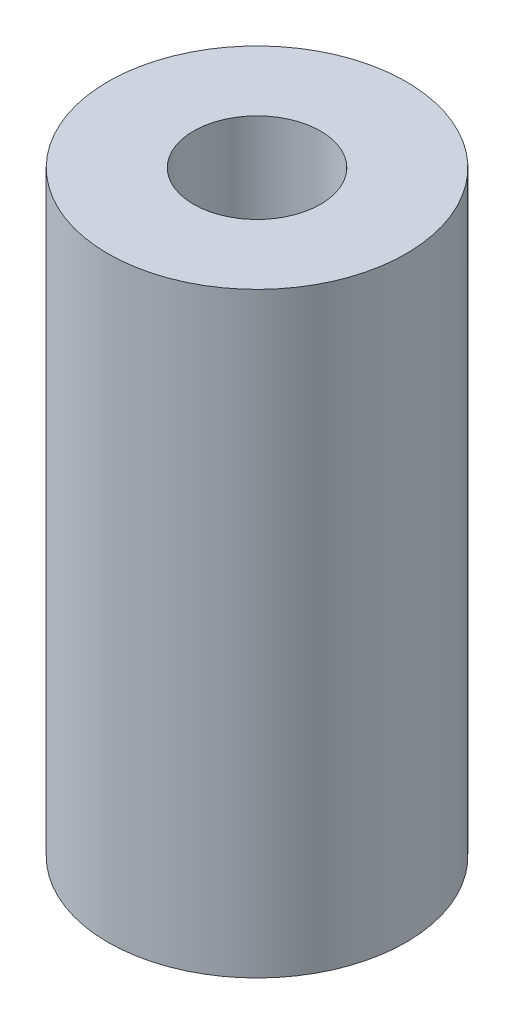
ISO-10303-21;
HEADER;
FILE_DESCRIPTION(('STEP AP214'),'2;1');
FILE_NAME('part.step','',(''),(''),'','','');
FILE_SCHEMA(('AUTOMOTIVE_DESIGN { 1 0 10303 214 1 1 1 1 }'));
ENDSEC;
DATA;
#1=APPLICATION_CONTEXT('core data for automotive mechanical design processes');
#2=APPLICATION_PROTOCOL_DEFINITION('international standard','automotive_design',2000,#1);
#3=PRODUCT_CONTEXT('',#1,'mechanical');
#4=PRODUCT('Part','Part','',(#3));
#5=PRODUCT_RELATED_PRODUCT_CATEGORY('part','',(#4));
#6=PRODUCT_DEFINITION_FORMATION('','',#4);
#7=PRODUCT_DEFINITION_CONTEXT('part definition',#1,'design');
#8=PRODUCT_DEFINITION('design','',#6,#7);
#9=PRODUCT_DEFINITION_SHAPE('','',#8);
#10=(LENGTH_UNIT() NAMED_UNIT(*) SI_UNIT(.MILLI.,.METRE.));
#11=(NAMED_UNIT(*) PLANE_ANGLE_UNIT() SI_UNIT($,.RADIAN.));
#12=(NAMED_UNIT(*) SI_UNIT($,.STERADIAN.) SOLID_ANGLE_UNIT());
#13=UNCERTAINTY_MEASURE_WITH_UNIT(LENGTH_MEASURE(1.E-05),#10,'distance_accuracy_value','');
#14=(GEOMETRIC_REPRESENTATION_CONTEXT(3) GLOBAL_UNCERTAINTY_ASSIGNED_CONTEXT((#13)) GLOBAL_UNIT_ASSIGNED_CONTEXT((#10,
#11,#12)) REPRESENTATION_CONTEXT('',''));
#15=CARTESIAN_POINT('',(0.,0.,0.));
#16=DIRECTION('',(0.,0.,1.));
#17=DIRECTION('',(1.,0.,0.));
#18=AXIS2_PLACEMENT_3D('',#15,#16,#17);
#19=CARTESIAN_POINT('',(0.,12.7,0.));
#20=DIRECTION('',(0.,-1.,0.));
#21=DIRECTION('',(0.,0.,-1.));
#22=AXIS2_PLACEMENT_3D('',#19,#20,#21);
#23=CYLINDRICAL_SURFACE('',#22,3.175);
#24=CARTESIAN_POINT('',(0.,12.7,0.));
#25=DIRECTION('',(0.,1.,0.));
#26=DIRECTION('',(0.,0.,1.));
#27=AXIS2_PLACEMENT_3D('',#24,#25,#26);
#28=CIRCLE('',#27,3.175);
#29=CARTESIAN_POINT('',(0.,12.7,3.175));
#30=VERTEX_POINT('',#29);
#31=EDGE_CURVE('E10',#30,#30,#28,.T.);
#32=ORIENTED_EDGE('',*,*,#31,.F.);
#33=EDGE_LOOP('',(#32));
#34=FACE_BOUND('',#33,.T.);
#35=CARTESIAN_POINT('',(0.,0.,0.));
#36=DIRECTION('',(0.,1.,0.));
#37=DIRECTION('',(0.,0.,1.));
#38=AXIS2_PLACEMENT_3D('',#35,#36,#37);
#39=CIRCLE('',#38,3.175);
#40=CARTESIAN_POINT('',(0.,0.,3.175));
#41=VERTEX_POINT('',#40);
#42=EDGE_CURVE('E32',#41,#41,#39,.T.);
#43=ORIENTED_EDGE('',*,*,#42,.T.);
#44=EDGE_LOOP('',(#43));
#45=FACE_BOUND('',#44,.T.);
#46=ADVANCED_FACE('F29',(#34,#45),#23,.T.);
#47=CARTESIAN_POINT('',(0.,12.7,0.));
#48=DIRECTION('',(0.,1.,0.));
#49=DIRECTION('',(0.,0.,1.));
#50=AXIS2_PLACEMENT_3D('',#47,#48,#49);
#51=PLANE('',#50);
#52=CARTESIAN_POINT('',(0.,12.7,0.));
#53=DIRECTION('',(0.,1.,0.));
#54=DIRECTION('',(0.,0.,1.));
#55=AXIS2_PLACEMENT_3D('',#52,#53,#54);
#56=CIRCLE('',#55,1.35254999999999);
#57=CARTESIAN_POINT('',(0.,12.7,1.35254999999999));
#58=VERTEX_POINT('',#57);
#59=EDGE_CURVE('E43',#58,#58,#56,.T.);
#60=ORIENTED_EDGE('',*,*,#59,.F.);
#61=EDGE_LOOP('',(#60));
#62=FACE_BOUND('',#61,.T.);
#63=ORIENTED_EDGE('',*,*,#31,.T.);
#64=EDGE_LOOP('',(#63));
#65=FACE_BOUND('',#64,.T.);
#66=ADVANCED_FACE('F49',(#62,#65),#51,.T.);
#67=CARTESIAN_POINT('',(0.,0.,0.));
#68=DIRECTION('',(0.,1.,0.));
#69=DIRECTION('',(0.,0.,1.));
#70=AXIS2_PLACEMENT_3D('',#67,#68,#69);
#71=PLANE('',#70);
#72=CARTESIAN_POINT('',(0.,0.,0.));
#73=DIRECTION('',(0.,1.,0.));
#74=DIRECTION('',(0.,0.,1.));
#75=AXIS2_PLACEMENT_3D('',#72,#73,#74);
#76=CIRCLE('',#75,1.35255);
#77=CARTESIAN_POINT('',(0.,0.,1.35255));
#78=VERTEX_POINT('',#77);
#79=EDGE_CURVE('E39',#78,#78,#76,.T.);
#80=ORIENTED_EDGE('',*,*,#79,.T.);
#81=EDGE_LOOP('',(#80));
#82=FACE_BOUND('',#81,.T.);
#83=ORIENTED_EDGE('',*,*,#42,.F.);
#84=EDGE_LOOP('',(#83));
#85=FACE_BOUND('',#84,.T.);
#86=ADVANCED_FACE('F51',(#82,#85),#71,.F.);
#87=CARTESIAN_POINT('',(0.,12.7,0.));
#88=DIRECTION('',(0.,1.,0.));
#89=DIRECTION('',(0.,0.,1.));
#90=AXIS2_PLACEMENT_3D('',#87,#88,#89);
#91=CYLINDRICAL_SURFACE('',#90,1.35254999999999);
#92=ORIENTED_EDGE('',*,*,#79,.F.);
#93=EDGE_LOOP('',(#92));
#94=FACE_BOUND('',#93,.T.);
#95=ORIENTED_EDGE('',*,*,#59,.T.);
#96=EDGE_LOOP('',(#95));
#97=FACE_BOUND('',#96,.T.);
#98=ADVANCED_FACE('F47',(#94,#97),#91,.F.);
#99=CLOSED_SHELL('',(#46,#66,#86,#98));
#100=MANIFOLD_SOLID_BREP('B2',#99);
#101=ADVANCED_BREP_SHAPE_REPRESENTATION('',(#18,#100),#14);
#102=SHAPE_DEFINITION_REPRESENTATION(#9,#101);
ENDSEC;
END-ISO-10303-21;
